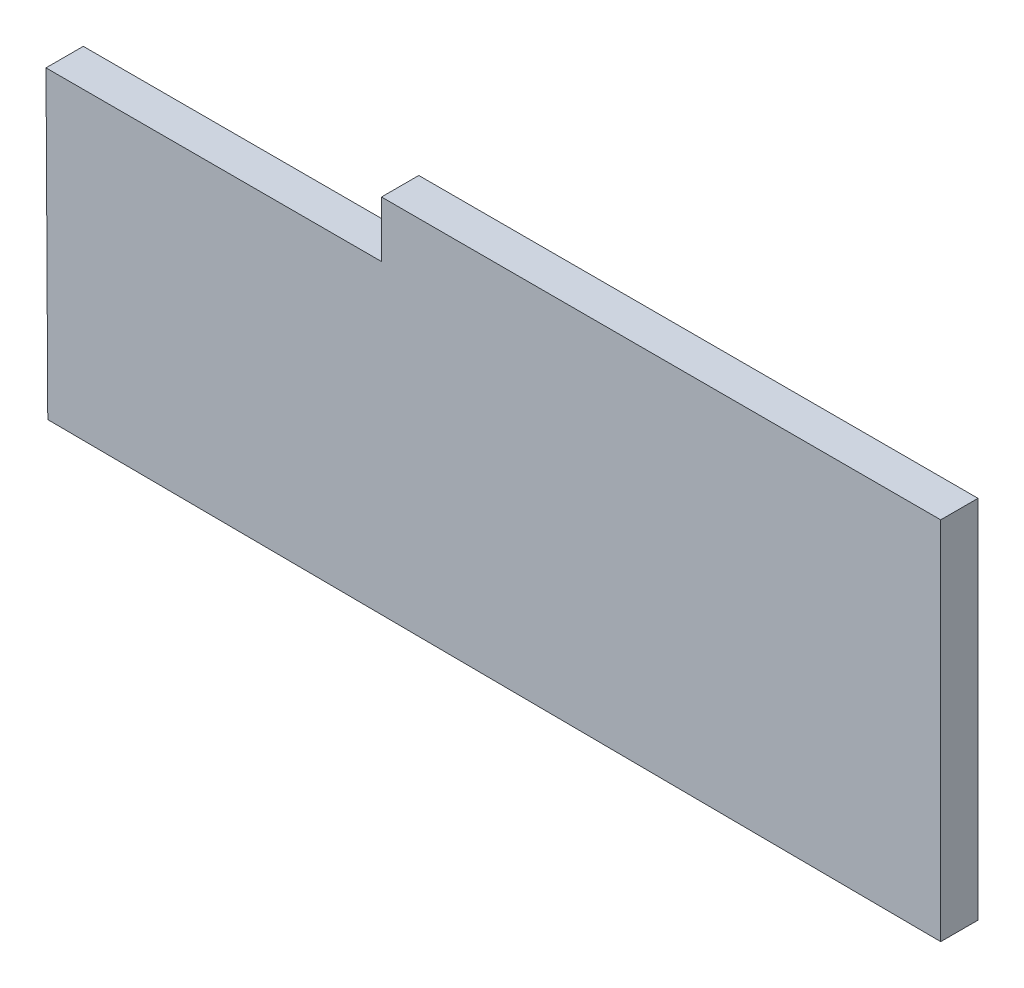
ISO-10303-21;
HEADER;
FILE_DESCRIPTION(('STEP AP214'),'2;1');
FILE_NAME('part.step','',(''),(''),'','','');
FILE_SCHEMA(('AUTOMOTIVE_DESIGN { 1 0 10303 214 1 1 1 1 }'));
ENDSEC;
DATA;
#1=APPLICATION_CONTEXT('core data for automotive mechanical design processes');
#2=APPLICATION_PROTOCOL_DEFINITION('international standard','automotive_design',2000,#1);
#3=PRODUCT_CONTEXT('',#1,'mechanical');
#4=PRODUCT('Part','Part','',(#3));
#5=PRODUCT_RELATED_PRODUCT_CATEGORY('part','',(#4));
#6=PRODUCT_DEFINITION_FORMATION('','',#4);
#7=PRODUCT_DEFINITION_CONTEXT('part definition',#1,'design');
#8=PRODUCT_DEFINITION('design','',#6,#7);
#9=PRODUCT_DEFINITION_SHAPE('','',#8);
#10=(LENGTH_UNIT() NAMED_UNIT(*) SI_UNIT(.MILLI.,.METRE.));
#11=(NAMED_UNIT(*) PLANE_ANGLE_UNIT() SI_UNIT($,.RADIAN.));
#12=(NAMED_UNIT(*) SI_UNIT($,.STERADIAN.) SOLID_ANGLE_UNIT());
#13=UNCERTAINTY_MEASURE_WITH_UNIT(LENGTH_MEASURE(1.E-05),#10,'distance_accuracy_value','');
#14=(GEOMETRIC_REPRESENTATION_CONTEXT(3) GLOBAL_UNCERTAINTY_ASSIGNED_CONTEXT((#13)) GLOBAL_UNIT_ASSIGNED_CONTEXT((#10,
#11,#12)) REPRESENTATION_CONTEXT('',''));
#15=CARTESIAN_POINT('',(0.,0.,0.));
#16=DIRECTION('',(0.,0.,1.));
#17=DIRECTION('',(1.,0.,0.));
#18=AXIS2_PLACEMENT_3D('',#15,#16,#17);
#19=CARTESIAN_POINT('',(-9.48818628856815,8.5,-1.));
#20=DIRECTION('',(0.,1.,0.));
#21=DIRECTION('',(0.,0.,1.));
#22=AXIS2_PLACEMENT_3D('',#19,#20,#21);
#23=PLANE('',#22);
#24=DIRECTION('',(-1.,0.,0.));
#25=VECTOR('',#24,1.);
#26=CARTESIAN_POINT('',(-9.48818628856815,8.5,0.));
#27=LINE('',#26,#25);
#28=CARTESIAN_POINT('',(-9.48818628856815,8.5,0.));
#29=VERTEX_POINT('',#28);
#30=CARTESIAN_POINT('',(-14.4881862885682,8.5,0.));
#31=VERTEX_POINT('',#30);
#32=EDGE_CURVE('E72',#29,#31,#27,.T.);
#33=ORIENTED_EDGE('',*,*,#32,.T.);
#34=DIRECTION('',(0.,0.,1.));
#35=VECTOR('',#34,1.);
#36=CARTESIAN_POINT('',(-14.4881862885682,8.5,-1.));
#37=LINE('',#36,#35);
#38=CARTESIAN_POINT('',(-14.4881862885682,8.5,-1.));
#39=VERTEX_POINT('',#38);
#40=EDGE_CURVE('E118',#39,#31,#37,.T.);
#41=ORIENTED_EDGE('',*,*,#40,.F.);
#42=DIRECTION('',(-1.,0.,0.));
#43=VECTOR('',#42,1.);
#44=CARTESIAN_POINT('',(-9.48818628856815,8.5,-1.));
#45=LINE('',#44,#43);
#46=CARTESIAN_POINT('',(-9.48818628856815,8.5,-1.));
#47=VERTEX_POINT('',#46);
#48=EDGE_CURVE('E59',#47,#39,#45,.T.);
#49=ORIENTED_EDGE('',*,*,#48,.F.);
#50=DIRECTION('',(0.,0.,1.));
#51=VECTOR('',#50,1.);
#52=CARTESIAN_POINT('',(-9.48818628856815,8.5,-1.));
#53=LINE('',#52,#51);
#54=EDGE_CURVE('E114',#47,#29,#53,.T.);
#55=ORIENTED_EDGE('',*,*,#54,.T.);
#56=EDGE_LOOP('',(#33,#41,#49,#55));
#57=FACE_BOUND('',#56,.T.);
#58=DIRECTION('',(-1.,0.,0.));
#59=VECTOR('',#58,1.);
#60=CARTESIAN_POINT('',(-9.48818628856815,8.5,-0.15));
#61=LINE('',#60,#59);
#62=CARTESIAN_POINT('',(-9.63818628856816,8.5,-0.15));
#63=VERTEX_POINT('',#62);
#64=CARTESIAN_POINT('',(-14.3381862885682,8.5,-0.15));
#65=VERTEX_POINT('',#64);
#66=EDGE_CURVE('E137',#63,#65,#61,.T.);
#67=ORIENTED_EDGE('',*,*,#66,.F.);
#68=DIRECTION('',(0.,0.,1.));
#69=VECTOR('',#68,1.);
#70=CARTESIAN_POINT('',(-9.63818628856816,8.5,-1.));
#71=LINE('',#70,#69);
#72=CARTESIAN_POINT('',(-9.63818628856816,8.5,-0.85));
#73=VERTEX_POINT('',#72);
#74=EDGE_CURVE('E141',#73,#63,#71,.T.);
#75=ORIENTED_EDGE('',*,*,#74,.F.);
#76=DIRECTION('',(-1.,0.,0.));
#77=VECTOR('',#76,1.);
#78=CARTESIAN_POINT('',(-9.48818628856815,8.5,-0.85));
#79=LINE('',#78,#77);
#80=CARTESIAN_POINT('',(-14.3381862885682,8.5,-0.85));
#81=VERTEX_POINT('',#80);
#82=EDGE_CURVE('E50',#73,#81,#79,.T.);
#83=ORIENTED_EDGE('',*,*,#82,.T.);
#84=DIRECTION('',(0.,0.,1.));
#85=VECTOR('',#84,1.);
#86=CARTESIAN_POINT('',(-14.3381862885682,8.5,-1.));
#87=LINE('',#86,#85);
#88=EDGE_CURVE('E83',#81,#65,#87,.T.);
#89=ORIENTED_EDGE('',*,*,#88,.T.);
#90=EDGE_LOOP('',(#67,#75,#83,#89));
#91=FACE_BOUND('',#90,.T.);
#92=ADVANCED_FACE('F35',(#57,#91),#23,.F.);
#93=CARTESIAN_POINT('',(-14.4881862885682,9.5,-1.));
#94=DIRECTION('',(1.,0.,0.));
#95=DIRECTION('',(0.,0.,-1.));
#96=AXIS2_PLACEMENT_3D('',#93,#94,#95);
#97=PLANE('',#96);
#98=DIRECTION('',(0.,1.,0.));
#99=VECTOR('',#98,1.);
#100=CARTESIAN_POINT('',(-14.4881862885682,9.5,0.));
#101=LINE('',#100,#99);
#102=CARTESIAN_POINT('',(-14.4881862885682,9.5,0.));
#103=VERTEX_POINT('',#102);
#104=EDGE_CURVE('E122',#31,#103,#101,.T.);
#105=ORIENTED_EDGE('',*,*,#104,.T.);
#106=DIRECTION('',(0.,0.,1.));
#107=VECTOR('',#106,1.);
#108=CARTESIAN_POINT('',(-14.4881862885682,9.5,-1.));
#109=LINE('',#108,#107);
#110=CARTESIAN_POINT('',(-14.4881862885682,9.5,-1.));
#111=VERTEX_POINT('',#110);
#112=EDGE_CURVE('E11',#111,#103,#109,.T.);
#113=ORIENTED_EDGE('',*,*,#112,.F.);
#114=DIRECTION('',(0.,1.,0.));
#115=VECTOR('',#114,1.);
#116=CARTESIAN_POINT('',(-14.4881862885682,9.5,-1.));
#117=LINE('',#116,#115);
#118=EDGE_CURVE('E103',#39,#111,#117,.T.);
#119=ORIENTED_EDGE('',*,*,#118,.F.);
#120=ORIENTED_EDGE('',*,*,#40,.T.);
#121=EDGE_LOOP('',(#105,#113,#119,#120));
#122=FACE_BOUND('',#121,.T.);
#123=ADVANCED_FACE('F37',(#122),#97,.F.);
#124=CARTESIAN_POINT('',(-9.48818628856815,9.5,-1.));
#125=DIRECTION('',(0.,-1.,0.));
#126=DIRECTION('',(0.,0.,-1.));
#127=AXIS2_PLACEMENT_3D('',#124,#125,#126);
#128=PLANE('',#127);
#129=DIRECTION('',(1.,0.,0.));
#130=VECTOR('',#129,1.);
#131=CARTESIAN_POINT('',(-9.48818628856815,9.5,0.));
#132=LINE('',#131,#130);
#133=CARTESIAN_POINT('',(-9.48818628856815,9.5,0.));
#134=VERTEX_POINT('',#133);
#135=EDGE_CURVE('E112',#103,#134,#132,.T.);
#136=ORIENTED_EDGE('',*,*,#135,.T.);
#137=DIRECTION('',(0.,0.,1.));
#138=VECTOR('',#137,1.);
#139=CARTESIAN_POINT('',(-9.48818628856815,9.5,-1.));
#140=LINE('',#139,#138);
#141=CARTESIAN_POINT('',(-9.48818628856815,9.5,-1.));
#142=VERTEX_POINT('',#141);
#143=EDGE_CURVE('E43',#142,#134,#140,.T.);
#144=ORIENTED_EDGE('',*,*,#143,.F.);
#145=DIRECTION('',(1.,0.,0.));
#146=VECTOR('',#145,1.);
#147=CARTESIAN_POINT('',(-9.48818628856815,9.5,-1.));
#148=LINE('',#147,#146);
#149=EDGE_CURVE('E96',#111,#142,#148,.T.);
#150=ORIENTED_EDGE('',*,*,#149,.F.);
#151=ORIENTED_EDGE('',*,*,#112,.T.);
#152=EDGE_LOOP('',(#136,#144,#150,#151));
#153=FACE_BOUND('',#152,.T.);
#154=ADVANCED_FACE('F109',(#153),#128,.F.);
#155=CARTESIAN_POINT('',(-9.48818628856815,9.5,-1.));
#156=DIRECTION('',(-1.,0.,0.));
#157=DIRECTION('',(0.,0.,1.));
#158=AXIS2_PLACEMENT_3D('',#155,#156,#157);
#159=PLANE('',#158);
#160=DIRECTION('',(0.,-1.,0.));
#161=VECTOR('',#160,1.);
#162=CARTESIAN_POINT('',(-9.48818628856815,9.5,0.));
#163=LINE('',#162,#161);
#164=EDGE_CURVE('E127',#134,#29,#163,.T.);
#165=ORIENTED_EDGE('',*,*,#164,.T.);
#166=ORIENTED_EDGE('',*,*,#54,.F.);
#167=DIRECTION('',(0.,-1.,0.));
#168=VECTOR('',#167,1.);
#169=CARTESIAN_POINT('',(-9.48818628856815,9.5,-1.));
#170=LINE('',#169,#168);
#171=EDGE_CURVE('E100',#142,#47,#170,.T.);
#172=ORIENTED_EDGE('',*,*,#171,.F.);
#173=ORIENTED_EDGE('',*,*,#143,.T.);
#174=EDGE_LOOP('',(#165,#166,#172,#173));
#175=FACE_BOUND('',#174,.T.);
#176=ADVANCED_FACE('F115',(#175),#159,.F.);
#177=CARTESIAN_POINT('',(0.,0.,-1.));
#178=DIRECTION('',(0.,0.,-1.));
#179=DIRECTION('',(-1.,0.,0.));
#180=AXIS2_PLACEMENT_3D('',#177,#178,#179);
#181=PLANE('',#180);
#182=ORIENTED_EDGE('',*,*,#118,.T.);
#183=ORIENTED_EDGE('',*,*,#149,.T.);
#184=ORIENTED_EDGE('',*,*,#171,.T.);
#185=ORIENTED_EDGE('',*,*,#48,.T.);
#186=EDGE_LOOP('',(#182,#183,#184,#185));
#187=FACE_BOUND('',#186,.T.);
#188=ADVANCED_FACE('F98',(#187),#181,.T.);
#189=CARTESIAN_POINT('',(-14.3381862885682,9.5,-1.));
#190=DIRECTION('',(1.,0.,0.));
#191=DIRECTION('',(0.,0.,-1.));
#192=AXIS2_PLACEMENT_3D('',#189,#190,#191);
#193=PLANE('',#192);
#194=DIRECTION('',(0.,1.,0.));
#195=VECTOR('',#194,1.);
#196=CARTESIAN_POINT('',(-14.3381862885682,9.5,-0.15));
#197=LINE('',#196,#195);
#198=CARTESIAN_POINT('',(-14.3381862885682,9.35,-0.15));
#199=VERTEX_POINT('',#198);
#200=EDGE_CURVE('E157',#65,#199,#197,.T.);
#201=ORIENTED_EDGE('',*,*,#200,.F.);
#202=ORIENTED_EDGE('',*,*,#88,.F.);
#203=DIRECTION('',(0.,1.,0.));
#204=VECTOR('',#203,1.);
#205=CARTESIAN_POINT('',(-14.3381862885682,9.5,-0.85));
#206=LINE('',#205,#204);
#207=CARTESIAN_POINT('',(-14.3381862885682,9.35,-0.85));
#208=VERTEX_POINT('',#207);
#209=EDGE_CURVE('E139',#81,#208,#206,.T.);
#210=ORIENTED_EDGE('',*,*,#209,.T.);
#211=DIRECTION('',(0.,0.,1.));
#212=VECTOR('',#211,1.);
#213=CARTESIAN_POINT('',(-14.3381862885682,9.35,-1.));
#214=LINE('',#213,#212);
#215=EDGE_CURVE('E125',#208,#199,#214,.T.);
#216=ORIENTED_EDGE('',*,*,#215,.T.);
#217=EDGE_LOOP('',(#201,#202,#210,#216));
#218=FACE_BOUND('',#217,.T.);
#219=ADVANCED_FACE('F263',(#218),#193,.T.);
#220=CARTESIAN_POINT('',(-9.48818628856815,9.35,-1.));
#221=DIRECTION('',(0.,-1.,0.));
#222=DIRECTION('',(0.,0.,-1.));
#223=AXIS2_PLACEMENT_3D('',#220,#221,#222);
#224=PLANE('',#223);
#225=DIRECTION('',(1.,0.,0.));
#226=VECTOR('',#225,1.);
#227=CARTESIAN_POINT('',(-9.48818628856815,9.35,-0.15));
#228=LINE('',#227,#226);
#229=CARTESIAN_POINT('',(-9.63818628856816,9.35,-0.15));
#230=VERTEX_POINT('',#229);
#231=EDGE_CURVE('E151',#199,#230,#228,.T.);
#232=ORIENTED_EDGE('',*,*,#231,.F.);
#233=ORIENTED_EDGE('',*,*,#215,.F.);
#234=DIRECTION('',(1.,0.,0.));
#235=VECTOR('',#234,1.);
#236=CARTESIAN_POINT('',(-9.48818628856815,9.35,-0.85));
#237=LINE('',#236,#235);
#238=CARTESIAN_POINT('',(-9.63818628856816,9.35,-0.85));
#239=VERTEX_POINT('',#238);
#240=EDGE_CURVE('E149',#208,#239,#237,.T.);
#241=ORIENTED_EDGE('',*,*,#240,.T.);
#242=DIRECTION('',(0.,0.,1.));
#243=VECTOR('',#242,1.);
#244=CARTESIAN_POINT('',(-9.63818628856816,9.35,-1.));
#245=LINE('',#244,#243);
#246=EDGE_CURVE('E144',#239,#230,#245,.T.);
#247=ORIENTED_EDGE('',*,*,#246,.T.);
#248=EDGE_LOOP('',(#232,#233,#241,#247));
#249=FACE_BOUND('',#248,.T.);
#250=ADVANCED_FACE('F264',(#249),#224,.T.);
#251=CARTESIAN_POINT('',(-9.63818628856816,9.5,-1.));
#252=DIRECTION('',(-1.,0.,0.));
#253=DIRECTION('',(0.,0.,1.));
#254=AXIS2_PLACEMENT_3D('',#251,#252,#253);
#255=PLANE('',#254);
#256=DIRECTION('',(0.,-1.,0.));
#257=VECTOR('',#256,1.);
#258=CARTESIAN_POINT('',(-9.63818628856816,9.5,-0.15));
#259=LINE('',#258,#257);
#260=EDGE_CURVE('E140',#230,#63,#259,.T.);
#261=ORIENTED_EDGE('',*,*,#260,.F.);
#262=ORIENTED_EDGE('',*,*,#246,.F.);
#263=DIRECTION('',(0.,-1.,0.));
#264=VECTOR('',#263,1.);
#265=CARTESIAN_POINT('',(-9.63818628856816,9.5,-0.85));
#266=LINE('',#265,#264);
#267=EDGE_CURVE('E146',#239,#73,#266,.T.);
#268=ORIENTED_EDGE('',*,*,#267,.T.);
#269=ORIENTED_EDGE('',*,*,#74,.T.);
#270=EDGE_LOOP('',(#261,#262,#268,#269));
#271=FACE_BOUND('',#270,.T.);
#272=ADVANCED_FACE('F271',(#271),#255,.T.);
#273=CARTESIAN_POINT('',(0.,0.,-0.85));
#274=DIRECTION('',(0.,0.,-1.));
#275=DIRECTION('',(-1.,0.,0.));
#276=AXIS2_PLACEMENT_3D('',#273,#274,#275);
#277=PLANE('',#276);
#278=ORIENTED_EDGE('',*,*,#209,.F.);
#279=ORIENTED_EDGE('',*,*,#82,.F.);
#280=ORIENTED_EDGE('',*,*,#267,.F.);
#281=ORIENTED_EDGE('',*,*,#240,.F.);
#282=EDGE_LOOP('',(#278,#279,#280,#281));
#283=FACE_BOUND('',#282,.T.);
#284=ADVANCED_FACE('F259',(#283),#277,.F.);
#285=CARTESIAN_POINT('',(0.,0.,-0.15));
#286=DIRECTION('',(0.,0.,-1.));
#287=DIRECTION('',(-1.,0.,0.));
#288=AXIS2_PLACEMENT_3D('',#285,#286,#287);
#289=PLANE('',#288);
#290=ORIENTED_EDGE('',*,*,#200,.T.);
#291=ORIENTED_EDGE('',*,*,#231,.T.);
#292=ORIENTED_EDGE('',*,*,#260,.T.);
#293=ORIENTED_EDGE('',*,*,#66,.T.);
#294=EDGE_LOOP('',(#290,#291,#292,#293));
#295=FACE_BOUND('',#294,.T.);
#296=ADVANCED_FACE('F267',(#295),#289,.T.);
#297=CARTESIAN_POINT('',(0.,0.,0.));
#298=DIRECTION('',(0.,0.,-1.));
#299=DIRECTION('',(-1.,0.,0.));
#300=AXIS2_PLACEMENT_3D('',#297,#298,#299);
#301=PLANE('',#300);
#302=DIRECTION('',(0.,1.,0.));
#303=VECTOR('',#302,1.);
#304=CARTESIAN_POINT('',(7.99999999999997,12.5,0.));
#305=LINE('',#304,#303);
#306=CARTESIAN_POINT('',(7.99999999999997,2.7,0.));
#307=VERTEX_POINT('',#306);
#308=CARTESIAN_POINT('',(7.99999999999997,12.5,0.));
#309=VERTEX_POINT('',#308);
#310=EDGE_CURVE('E198',#307,#309,#305,.T.);
#311=ORIENTED_EDGE('',*,*,#310,.F.);
#312=DIRECTION('',(0.999979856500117,-0.00634717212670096,0.));
#313=VECTOR('',#312,1.);
#314=CARTESIAN_POINT('',(7.99999999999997,2.7,0.));
#315=LINE('',#314,#313);
#316=CARTESIAN_POINT('',(-15.9521521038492,2.85203149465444,0.));
#317=VERTEX_POINT('',#316);
#318=EDGE_CURVE('E182',#317,#307,#315,.T.);
#319=ORIENTED_EDGE('',*,*,#318,.F.);
#320=DIRECTION('',(0.0058722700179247,-0.999982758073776,0.));
#321=VECTOR('',#320,1.);
#322=CARTESIAN_POINT('',(-15.9521521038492,2.85203149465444,0.));
#323=LINE('',#322,#321);
#324=CARTESIAN_POINT('',(-16.,11.,0.));
#325=VERTEX_POINT('',#324);
#326=EDGE_CURVE('E186',#325,#317,#323,.T.);
#327=ORIENTED_EDGE('',*,*,#326,.F.);
#328=DIRECTION('',(-1.,0.,0.));
#329=VECTOR('',#328,1.);
#330=CARTESIAN_POINT('',(-7.00000000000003,11.,0.));
#331=LINE('',#330,#329);
#332=CARTESIAN_POINT('',(-7.00000000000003,11.,0.));
#333=VERTEX_POINT('',#332);
#334=EDGE_CURVE('E189',#333,#325,#331,.T.);
#335=ORIENTED_EDGE('',*,*,#334,.F.);
#336=DIRECTION('',(0.,-1.,0.));
#337=VECTOR('',#336,1.);
#338=CARTESIAN_POINT('',(-7.00000000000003,12.5,0.));
#339=LINE('',#338,#337);
#340=CARTESIAN_POINT('',(-7.00000000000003,12.5,0.));
#341=VERTEX_POINT('',#340);
#342=EDGE_CURVE('E192',#341,#333,#339,.T.);
#343=ORIENTED_EDGE('',*,*,#342,.F.);
#344=DIRECTION('',(-1.,0.,0.));
#345=VECTOR('',#344,1.);
#346=CARTESIAN_POINT('',(7.99999999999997,12.5,0.));
#347=LINE('',#346,#345);
#348=EDGE_CURVE('E195',#309,#341,#347,.T.);
#349=ORIENTED_EDGE('',*,*,#348,.F.);
#350=EDGE_LOOP('',(#311,#319,#327,#335,#343,#349));
#351=FACE_BOUND('',#350,.T.);
#352=ORIENTED_EDGE('',*,*,#32,.F.);
#353=ORIENTED_EDGE('',*,*,#164,.F.);
#354=ORIENTED_EDGE('',*,*,#135,.F.);
#355=ORIENTED_EDGE('',*,*,#104,.F.);
#356=EDGE_LOOP('',(#352,#353,#354,#355));
#357=FACE_BOUND('',#356,.T.);
#358=ADVANCED_FACE('F322',(#351,#357),#301,.T.);
#359=CARTESIAN_POINT('',(7.99999999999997,12.5,1.));
#360=DIRECTION('',(-1.,0.,0.));
#361=DIRECTION('',(0.,-1.,0.));
#362=AXIS2_PLACEMENT_3D('',#359,#360,#361);
#363=PLANE('',#362);
#364=ORIENTED_EDGE('',*,*,#310,.T.);
#365=DIRECTION('',(0.,0.,-1.));
#366=VECTOR('',#365,1.);
#367=CARTESIAN_POINT('',(7.99999999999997,12.5,1.));
#368=LINE('',#367,#366);
#369=CARTESIAN_POINT('',(7.99999999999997,12.5,1.));
#370=VERTEX_POINT('',#369);
#371=EDGE_CURVE('E163',#370,#309,#368,.T.);
#372=ORIENTED_EDGE('',*,*,#371,.F.);
#373=DIRECTION('',(0.,1.,0.));
#374=VECTOR('',#373,1.);
#375=CARTESIAN_POINT('',(7.99999999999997,12.5,1.));
#376=LINE('',#375,#374);
#377=CARTESIAN_POINT('',(7.99999999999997,2.7,1.));
#378=VERTEX_POINT('',#377);
#379=EDGE_CURVE('E185',#378,#370,#376,.T.);
#380=ORIENTED_EDGE('',*,*,#379,.F.);
#381=DIRECTION('',(0.,0.,-1.));
#382=VECTOR('',#381,1.);
#383=CARTESIAN_POINT('',(7.99999999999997,2.7,1.));
#384=LINE('',#383,#382);
#385=EDGE_CURVE('E178',#378,#307,#384,.T.);
#386=ORIENTED_EDGE('',*,*,#385,.T.);
#387=EDGE_LOOP('',(#364,#372,#380,#386));
#388=FACE_BOUND('',#387,.T.);
#389=ADVANCED_FACE('F230',(#388),#363,.F.);
#390=CARTESIAN_POINT('',(7.99999999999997,12.5,1.));
#391=DIRECTION('',(0.,-1.,0.));
#392=DIRECTION('',(1.,0.,0.));
#393=AXIS2_PLACEMENT_3D('',#390,#391,#392);
#394=PLANE('',#393);
#395=ORIENTED_EDGE('',*,*,#348,.T.);
#396=DIRECTION('',(0.,0.,-1.));
#397=VECTOR('',#396,1.);
#398=CARTESIAN_POINT('',(-7.00000000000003,12.5,1.));
#399=LINE('',#398,#397);
#400=CARTESIAN_POINT('',(-7.00000000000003,12.5,1.));
#401=VERTEX_POINT('',#400);
#402=EDGE_CURVE('E166',#401,#341,#399,.T.);
#403=ORIENTED_EDGE('',*,*,#402,.F.);
#404=DIRECTION('',(-1.,0.,0.));
#405=VECTOR('',#404,1.);
#406=CARTESIAN_POINT('',(7.99999999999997,12.5,1.));
#407=LINE('',#406,#405);
#408=EDGE_CURVE('E212',#370,#401,#407,.T.);
#409=ORIENTED_EDGE('',*,*,#408,.F.);
#410=ORIENTED_EDGE('',*,*,#371,.T.);
#411=EDGE_LOOP('',(#395,#403,#409,#410));
#412=FACE_BOUND('',#411,.T.);
#413=ADVANCED_FACE('F234',(#412),#394,.F.);
#414=CARTESIAN_POINT('',(-7.00000000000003,12.5,1.));
#415=DIRECTION('',(1.,0.,0.));
#416=DIRECTION('',(0.,0.,-1.));
#417=AXIS2_PLACEMENT_3D('',#414,#415,#416);
#418=PLANE('',#417);
#419=ORIENTED_EDGE('',*,*,#342,.T.);
#420=DIRECTION('',(0.,0.,-1.));
#421=VECTOR('',#420,1.);
#422=CARTESIAN_POINT('',(-7.00000000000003,11.,1.));
#423=LINE('',#422,#421);
#424=CARTESIAN_POINT('',(-7.00000000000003,11.,1.));
#425=VERTEX_POINT('',#424);
#426=EDGE_CURVE('E169',#425,#333,#423,.T.);
#427=ORIENTED_EDGE('',*,*,#426,.F.);
#428=DIRECTION('',(0.,-1.,0.));
#429=VECTOR('',#428,1.);
#430=CARTESIAN_POINT('',(-7.00000000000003,12.5,1.));
#431=LINE('',#430,#429);
#432=EDGE_CURVE('E209',#401,#425,#431,.T.);
#433=ORIENTED_EDGE('',*,*,#432,.F.);
#434=ORIENTED_EDGE('',*,*,#402,.T.);
#435=EDGE_LOOP('',(#419,#427,#433,#434));
#436=FACE_BOUND('',#435,.T.);
#437=ADVANCED_FACE('F343',(#436),#418,.F.);
#438=CARTESIAN_POINT('',(-7.00000000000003,11.,1.));
#439=DIRECTION('',(0.,-1.,0.));
#440=DIRECTION('',(0.,0.,-1.));
#441=AXIS2_PLACEMENT_3D('',#438,#439,#440);
#442=PLANE('',#441);
#443=ORIENTED_EDGE('',*,*,#334,.T.);
#444=DIRECTION('',(0.,0.,-1.));
#445=VECTOR('',#444,1.);
#446=CARTESIAN_POINT('',(-16.,11.,1.));
#447=LINE('',#446,#445);
#448=CARTESIAN_POINT('',(-16.,11.,1.));
#449=VERTEX_POINT('',#448);
#450=EDGE_CURVE('E172',#449,#325,#447,.T.);
#451=ORIENTED_EDGE('',*,*,#450,.F.);
#452=DIRECTION('',(-1.,0.,0.));
#453=VECTOR('',#452,1.);
#454=CARTESIAN_POINT('',(-7.00000000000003,11.,1.));
#455=LINE('',#454,#453);
#456=EDGE_CURVE('E206',#425,#449,#455,.T.);
#457=ORIENTED_EDGE('',*,*,#456,.F.);
#458=ORIENTED_EDGE('',*,*,#426,.T.);
#459=EDGE_LOOP('',(#443,#451,#457,#458));
#460=FACE_BOUND('',#459,.T.);
#461=ADVANCED_FACE('F352',(#460),#442,.F.);
#462=CARTESIAN_POINT('',(-15.9521521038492,2.85203149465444,1.));
#463=DIRECTION('',(0.999982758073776,0.0058722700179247,0.));
#464=DIRECTION('',(-0.0058722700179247,0.999982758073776,0.));
#465=AXIS2_PLACEMENT_3D('',#462,#463,#464);
#466=PLANE('',#465);
#467=ORIENTED_EDGE('',*,*,#326,.T.);
#468=DIRECTION('',(0.,0.,-1.));
#469=VECTOR('',#468,1.);
#470=CARTESIAN_POINT('',(-15.9521521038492,2.85203149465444,1.));
#471=LINE('',#470,#469);
#472=CARTESIAN_POINT('',(-15.9521521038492,2.85203149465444,1.));
#473=VERTEX_POINT('',#472);
#474=EDGE_CURVE('E175',#473,#317,#471,.T.);
#475=ORIENTED_EDGE('',*,*,#474,.F.);
#476=DIRECTION('',(0.0058722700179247,-0.999982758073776,0.));
#477=VECTOR('',#476,1.);
#478=CARTESIAN_POINT('',(-15.9521521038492,2.85203149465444,1.));
#479=LINE('',#478,#477);
#480=EDGE_CURVE('E203',#449,#473,#479,.T.);
#481=ORIENTED_EDGE('',*,*,#480,.F.);
#482=ORIENTED_EDGE('',*,*,#450,.T.);
#483=EDGE_LOOP('',(#467,#475,#481,#482));
#484=FACE_BOUND('',#483,.T.);
#485=ADVANCED_FACE('F362',(#484),#466,.F.);
#486=CARTESIAN_POINT('',(7.99999999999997,2.7,1.));
#487=DIRECTION('',(0.00634717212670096,0.999979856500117,0.));
#488=DIRECTION('',(-0.999979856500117,0.00634717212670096,0.));
#489=AXIS2_PLACEMENT_3D('',#486,#487,#488);
#490=PLANE('',#489);
#491=ORIENTED_EDGE('',*,*,#318,.T.);
#492=ORIENTED_EDGE('',*,*,#385,.F.);
#493=DIRECTION('',(0.999979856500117,-0.00634717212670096,0.));
#494=VECTOR('',#493,1.);
#495=CARTESIAN_POINT('',(7.99999999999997,2.7,1.));
#496=LINE('',#495,#494);
#497=EDGE_CURVE('E181',#473,#378,#496,.T.);
#498=ORIENTED_EDGE('',*,*,#497,.F.);
#499=ORIENTED_EDGE('',*,*,#474,.T.);
#500=EDGE_LOOP('',(#491,#492,#498,#499));
#501=FACE_BOUND('',#500,.T.);
#502=ADVANCED_FACE('F372',(#501),#490,.F.);
#503=CARTESIAN_POINT('',(0.,0.,1.));
#504=DIRECTION('',(0.,0.,-1.));
#505=DIRECTION('',(-1.,0.,0.));
#506=AXIS2_PLACEMENT_3D('',#503,#504,#505);
#507=PLANE('',#506);
#508=ORIENTED_EDGE('',*,*,#379,.T.);
#509=ORIENTED_EDGE('',*,*,#408,.T.);
#510=ORIENTED_EDGE('',*,*,#432,.T.);
#511=ORIENTED_EDGE('',*,*,#456,.T.);
#512=ORIENTED_EDGE('',*,*,#480,.T.);
#513=ORIENTED_EDGE('',*,*,#497,.T.);
#514=EDGE_LOOP('',(#508,#509,#510,#511,#512,#513));
#515=FACE_BOUND('',#514,.T.);
#516=ADVANCED_FACE('F220',(#515),#507,.F.);
#517=CLOSED_SHELL('',(#92,#123,#154,#176,#188,#219,#250,#272,#284,#296,#358,#389,#413,#437,#461,
#485,#502,#516));
#518=MANIFOLD_SOLID_BREP('B2',#517);
#519=ADVANCED_BREP_SHAPE_REPRESENTATION('',(#18,#518),#14);
#520=SHAPE_DEFINITION_REPRESENTATION(#9,#519);
ENDSEC;
END-ISO-10303-21;
